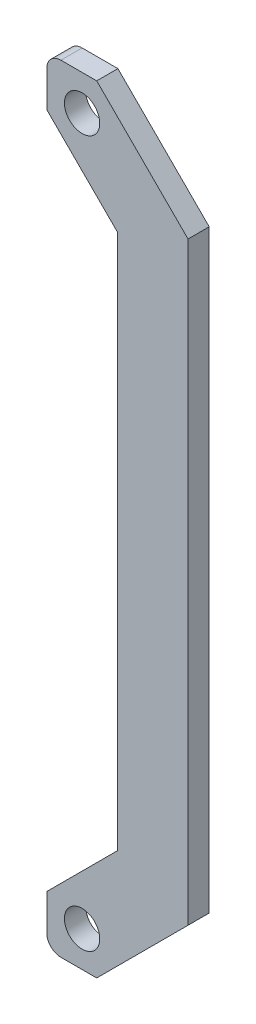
from build123d import *

# Parameters (mm, degrees)
CROQUIS1_R              = 2.5
SALIENTE_EXTRUIR1_DEPTH = 1.5
REDONDEO1_R             = 2


with BuildPart() as part:
    # Croquis1 → Saliente-Extruir1 (new, symmetric)
    with BuildSketch(Plane.XY):
        Polygon((-5, 37.928932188), (-5, -37.928932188), (-15, -47.928932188), (-15, -55), (-7.928932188, -55), (5, -42.071067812), (5, 42.071067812), (-7.928932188, 55), (-15, 55), (-15, 47.928932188), align=None)
        with Locations((-10, 50)):
            Circle(CROQUIS1_R, mode=Mode.SUBTRACT)
        with Locations(Location((-10, -50, 0), (0, 0, 180))):
            Circle(CROQUIS1_R, mode=Mode.SUBTRACT)
    extrude(amount=SALIENTE_EXTRUIR1_DEPTH, both=True)

    # Redondeo1
    redondeo1_edges = [part.edges().sort_by_distance(p)[0] for p in [
        (-15, 55, 0),
        (-15, -55, 0),
    ]]
    fillet(redondeo1_edges, radius=REDONDEO1_R)


solid = part.part
